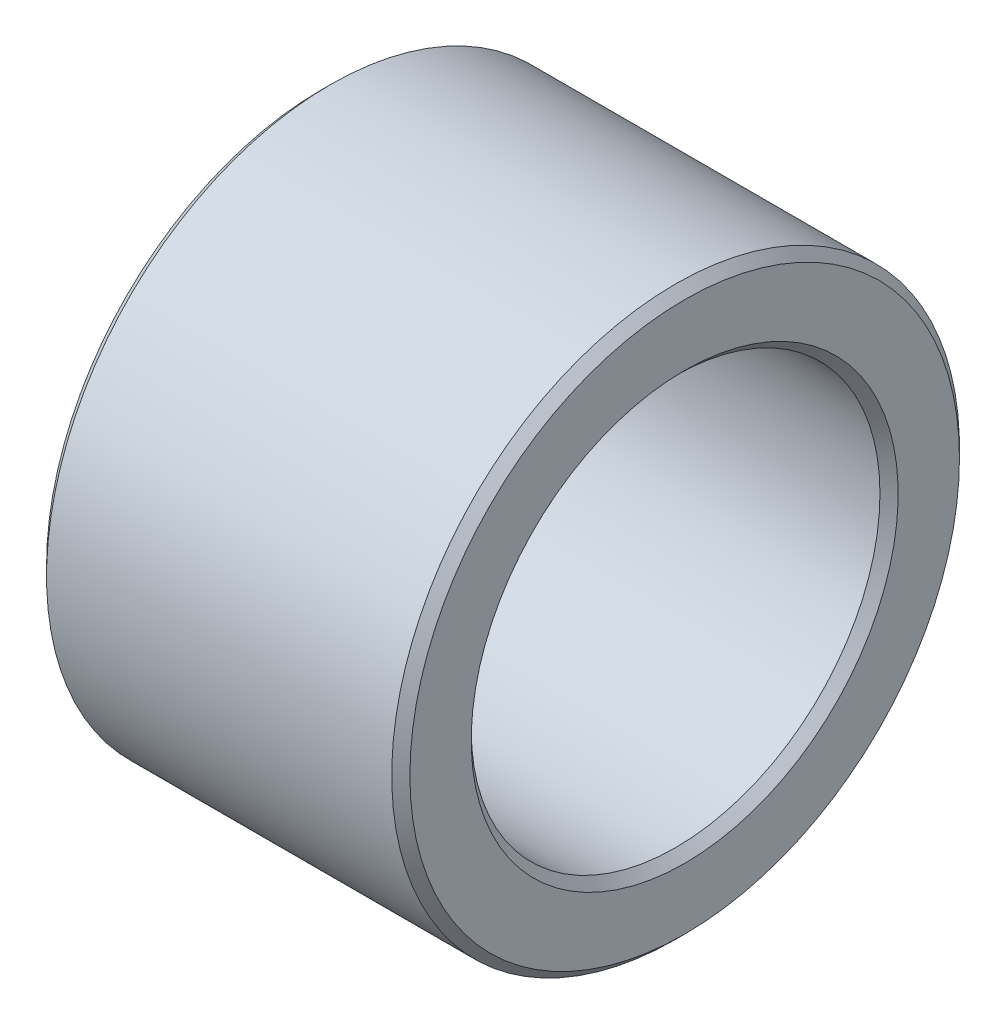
ISO-10303-21;
HEADER;
FILE_DESCRIPTION(('STEP AP214'),'2;1');
FILE_NAME('part.step','',(''),(''),'','','');
FILE_SCHEMA(('AUTOMOTIVE_DESIGN { 1 0 10303 214 1 1 1 1 }'));
ENDSEC;
DATA;
#1=APPLICATION_CONTEXT('core data for automotive mechanical design processes');
#2=APPLICATION_PROTOCOL_DEFINITION('international standard','automotive_design',2000,#1);
#3=PRODUCT_CONTEXT('',#1,'mechanical');
#4=PRODUCT('Part','Part','',(#3));
#5=PRODUCT_RELATED_PRODUCT_CATEGORY('part','',(#4));
#6=PRODUCT_DEFINITION_FORMATION('','',#4);
#7=PRODUCT_DEFINITION_CONTEXT('part definition',#1,'design');
#8=PRODUCT_DEFINITION('design','',#6,#7);
#9=PRODUCT_DEFINITION_SHAPE('','',#8);
#10=(LENGTH_UNIT() NAMED_UNIT(*) SI_UNIT(.MILLI.,.METRE.));
#11=(NAMED_UNIT(*) PLANE_ANGLE_UNIT() SI_UNIT($,.RADIAN.));
#12=(NAMED_UNIT(*) SI_UNIT($,.STERADIAN.) SOLID_ANGLE_UNIT());
#13=UNCERTAINTY_MEASURE_WITH_UNIT(LENGTH_MEASURE(1.E-05),#10,'distance_accuracy_value','');
#14=(GEOMETRIC_REPRESENTATION_CONTEXT(3) GLOBAL_UNCERTAINTY_ASSIGNED_CONTEXT((#13)) GLOBAL_UNIT_ASSIGNED_CONTEXT((#10,
#11,#12)) REPRESENTATION_CONTEXT('',''));
#15=CARTESIAN_POINT('',(0.,0.,0.));
#16=DIRECTION('',(0.,0.,1.));
#17=DIRECTION('',(1.,0.,0.));
#18=AXIS2_PLACEMENT_3D('',#15,#16,#17);
#19=CARTESIAN_POINT('',(0.,-10.75,0.));
#20=DIRECTION('',(-1.,0.,0.));
#21=DIRECTION('',(0.,1.,0.));
#22=AXIS2_PLACEMENT_3D('',#19,#20,#21);
#23=PLANE('',#22);
#24=CARTESIAN_POINT('',(0.,0.,0.));
#25=DIRECTION('',(1.,0.,0.));
#26=DIRECTION('',(0.,-1.,0.));
#27=AXIS2_PLACEMENT_3D('',#24,#25,#26);
#28=CIRCLE('',#27,9.4);
#29=CARTESIAN_POINT('',(0.,-9.4,0.));
#30=VERTEX_POINT('',#29);
#31=EDGE_CURVE('E9',#30,#30,#28,.T.);
#32=ORIENTED_EDGE('',*,*,#31,.T.);
#33=EDGE_LOOP('',(#32));
#34=FACE_BOUND('',#33,.T.);
#35=CARTESIAN_POINT('',(0.,0.,0.));
#36=DIRECTION('',(1.,0.,0.));
#37=DIRECTION('',(0.,-1.,0.));
#38=AXIS2_PLACEMENT_3D('',#35,#36,#37);
#39=CIRCLE('',#38,12.1);
#40=CARTESIAN_POINT('',(0.,-12.1,0.));
#41=VERTEX_POINT('',#40);
#42=EDGE_CURVE('E61',#41,#41,#39,.T.);
#43=ORIENTED_EDGE('',*,*,#42,.F.);
#44=EDGE_LOOP('',(#43));
#45=FACE_BOUND('',#44,.T.);
#46=ADVANCED_FACE('F15',(#34,#45),#23,.T.);
#47=CARTESIAN_POINT('',(0.2,0.,0.));
#48=DIRECTION('',(-1.,0.,0.));
#49=DIRECTION('',(0.,-1.,0.));
#50=AXIS2_PLACEMENT_3D('',#47,#48,#49);
#51=CONICAL_SURFACE('',#50,9.2,0.785398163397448);
#52=CARTESIAN_POINT('',(0.4,0.,0.));
#53=DIRECTION('',(1.,0.,0.));
#54=DIRECTION('',(0.,-1.,0.));
#55=AXIS2_PLACEMENT_3D('',#52,#53,#54);
#56=CIRCLE('',#55,9.);
#57=CARTESIAN_POINT('',(0.4,-9.,0.));
#58=VERTEX_POINT('',#57);
#59=EDGE_CURVE('E18',#58,#58,#56,.T.);
#60=ORIENTED_EDGE('',*,*,#59,.T.);
#61=EDGE_LOOP('',(#60));
#62=FACE_BOUND('',#61,.T.);
#63=ORIENTED_EDGE('',*,*,#31,.F.);
#64=EDGE_LOOP('',(#63));
#65=FACE_BOUND('',#64,.T.);
#66=ADVANCED_FACE('F81',(#62,#65),#51,.F.);
#67=CARTESIAN_POINT('',(8.,0.,0.));
#68=DIRECTION('',(-1.,0.,0.));
#69=DIRECTION('',(0.,-1.,0.));
#70=AXIS2_PLACEMENT_3D('',#67,#68,#69);
#71=CYLINDRICAL_SURFACE('',#70,9.);
#72=CARTESIAN_POINT('',(15.6,0.,0.));
#73=DIRECTION('',(1.,0.,0.));
#74=DIRECTION('',(0.,-1.,0.));
#75=AXIS2_PLACEMENT_3D('',#72,#73,#74);
#76=CIRCLE('',#75,9.);
#77=CARTESIAN_POINT('',(15.6,-9.,0.));
#78=VERTEX_POINT('',#77);
#79=EDGE_CURVE('E54',#78,#78,#76,.T.);
#80=ORIENTED_EDGE('',*,*,#79,.T.);
#81=EDGE_LOOP('',(#80));
#82=FACE_BOUND('',#81,.T.);
#83=ORIENTED_EDGE('',*,*,#59,.F.);
#84=EDGE_LOOP('',(#83));
#85=FACE_BOUND('',#84,.T.);
#86=ADVANCED_FACE('F85',(#82,#85),#71,.F.);
#87=CARTESIAN_POINT('',(15.8,0.,0.));
#88=DIRECTION('',(1.,0.,0.));
#89=DIRECTION('',(0.,-1.,0.));
#90=AXIS2_PLACEMENT_3D('',#87,#88,#89);
#91=CONICAL_SURFACE('',#90,9.2,0.785398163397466);
#92=CARTESIAN_POINT('',(16.,0.,0.));
#93=DIRECTION('',(1.,0.,0.));
#94=DIRECTION('',(0.,-1.,0.));
#95=AXIS2_PLACEMENT_3D('',#92,#93,#94);
#96=CIRCLE('',#95,9.4);
#97=CARTESIAN_POINT('',(16.,-9.4,0.));
#98=VERTEX_POINT('',#97);
#99=EDGE_CURVE('E50',#98,#98,#96,.T.);
#100=ORIENTED_EDGE('',*,*,#99,.T.);
#101=EDGE_LOOP('',(#100));
#102=FACE_BOUND('',#101,.T.);
#103=ORIENTED_EDGE('',*,*,#79,.F.);
#104=EDGE_LOOP('',(#103));
#105=FACE_BOUND('',#104,.T.);
#106=ADVANCED_FACE('F51',(#102,#105),#91,.F.);
#107=CARTESIAN_POINT('',(16.,-10.75,0.));
#108=DIRECTION('',(1.,0.,0.));
#109=DIRECTION('',(0.,-1.,0.));
#110=AXIS2_PLACEMENT_3D('',#107,#108,#109);
#111=PLANE('',#110);
#112=CARTESIAN_POINT('',(16.,0.,0.));
#113=DIRECTION('',(1.,0.,0.));
#114=DIRECTION('',(0.,-1.,0.));
#115=AXIS2_PLACEMENT_3D('',#112,#113,#114);
#116=CIRCLE('',#115,12.1);
#117=CARTESIAN_POINT('',(16.,-12.1,0.));
#118=VERTEX_POINT('',#117);
#119=EDGE_CURVE('E55',#118,#118,#116,.T.);
#120=ORIENTED_EDGE('',*,*,#119,.T.);
#121=EDGE_LOOP('',(#120));
#122=FACE_BOUND('',#121,.T.);
#123=ORIENTED_EDGE('',*,*,#99,.F.);
#124=EDGE_LOOP('',(#123));
#125=FACE_BOUND('',#124,.T.);
#126=ADVANCED_FACE('F97',(#122,#125),#111,.T.);
#127=CARTESIAN_POINT('',(15.8,0.,0.));
#128=DIRECTION('',(-1.,0.,0.));
#129=DIRECTION('',(0.,-1.,0.));
#130=AXIS2_PLACEMENT_3D('',#127,#128,#129);
#131=CONICAL_SURFACE('',#130,12.3,0.785398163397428);
#132=CARTESIAN_POINT('',(15.6,0.,0.));
#133=DIRECTION('',(1.,0.,0.));
#134=DIRECTION('',(0.,-1.,0.));
#135=AXIS2_PLACEMENT_3D('',#132,#133,#134);
#136=CIRCLE('',#135,12.5);
#137=CARTESIAN_POINT('',(15.6,-12.5,0.));
#138=VERTEX_POINT('',#137);
#139=EDGE_CURVE('E57',#138,#138,#136,.T.);
#140=ORIENTED_EDGE('',*,*,#139,.T.);
#141=EDGE_LOOP('',(#140));
#142=FACE_BOUND('',#141,.T.);
#143=ORIENTED_EDGE('',*,*,#119,.F.);
#144=EDGE_LOOP('',(#143));
#145=FACE_BOUND('',#144,.T.);
#146=ADVANCED_FACE('F77',(#142,#145),#131,.T.);
#147=CARTESIAN_POINT('',(8.,0.,0.));
#148=DIRECTION('',(-1.,0.,0.));
#149=DIRECTION('',(0.,-1.,0.));
#150=AXIS2_PLACEMENT_3D('',#147,#148,#149);
#151=CYLINDRICAL_SURFACE('',#150,12.5);
#152=CARTESIAN_POINT('',(0.4,0.,0.));
#153=DIRECTION('',(1.,0.,0.));
#154=DIRECTION('',(0.,-1.,0.));
#155=AXIS2_PLACEMENT_3D('',#152,#153,#154);
#156=CIRCLE('',#155,12.5);
#157=CARTESIAN_POINT('',(0.4,-12.5,0.));
#158=VERTEX_POINT('',#157);
#159=EDGE_CURVE('E62',#158,#158,#156,.T.);
#160=ORIENTED_EDGE('',*,*,#159,.T.);
#161=EDGE_LOOP('',(#160));
#162=FACE_BOUND('',#161,.T.);
#163=ORIENTED_EDGE('',*,*,#139,.F.);
#164=EDGE_LOOP('',(#163));
#165=FACE_BOUND('',#164,.T.);
#166=ADVANCED_FACE('F66',(#162,#165),#151,.T.);
#167=CARTESIAN_POINT('',(0.2,0.,0.));
#168=DIRECTION('',(1.,0.,0.));
#169=DIRECTION('',(0.,-1.,0.));
#170=AXIS2_PLACEMENT_3D('',#167,#168,#169);
#171=CONICAL_SURFACE('',#170,12.3,0.78539816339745);
#172=ORIENTED_EDGE('',*,*,#42,.T.);
#173=EDGE_LOOP('',(#172));
#174=FACE_BOUND('',#173,.T.);
#175=ORIENTED_EDGE('',*,*,#159,.F.);
#176=EDGE_LOOP('',(#175));
#177=FACE_BOUND('',#176,.T.);
#178=ADVANCED_FACE('F69',(#174,#177),#171,.T.);
#179=CLOSED_SHELL('',(#46,#66,#86,#106,#126,#146,#166,#178));
#180=MANIFOLD_SOLID_BREP('B1',#179);
#181=ADVANCED_BREP_SHAPE_REPRESENTATION('',(#18,#180),#14);
#182=SHAPE_DEFINITION_REPRESENTATION(#9,#181);
ENDSEC;
END-ISO-10303-21;
